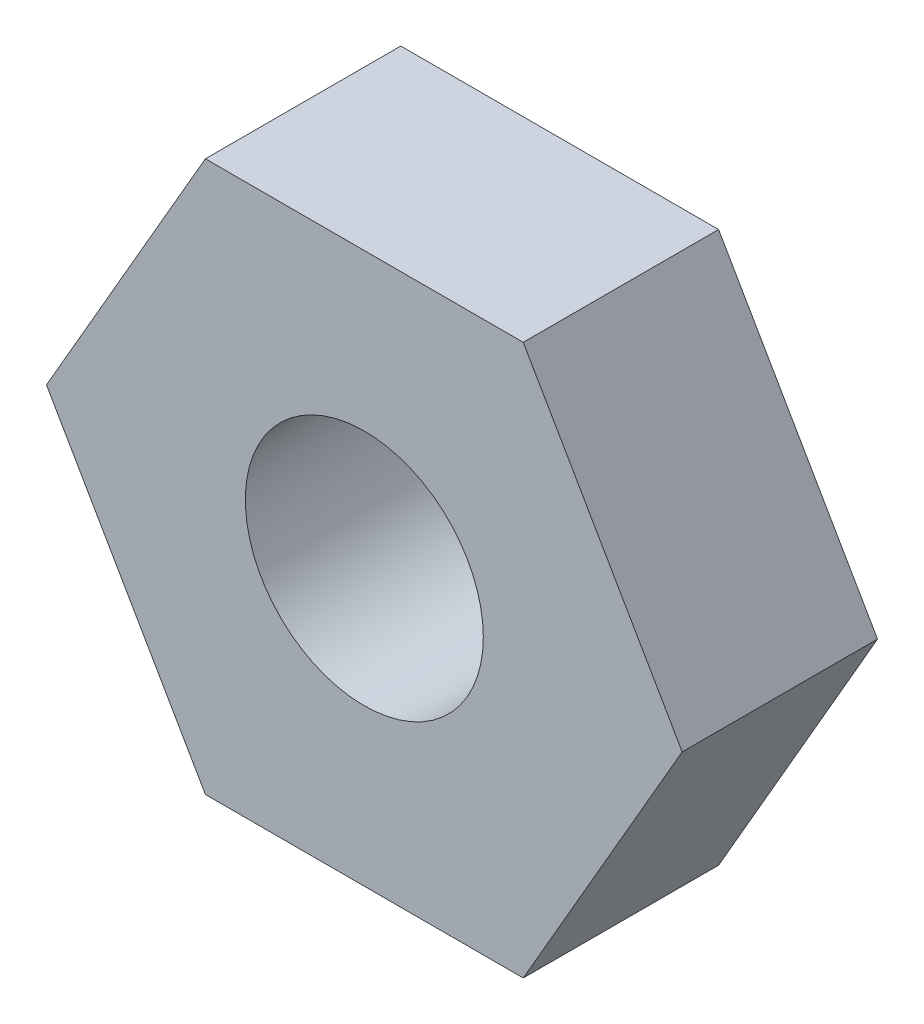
from build123d import *

# Parameters (mm, degrees)
BOSS_EXTRUDE1_DEPTH = 2.794
SKETCH2_R           = 1.7018
CUT_EXTRUDE1_DEPTH  = 7.631216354


with BuildPart() as part:
    # Sketch1 → Boss-Extrude1 (new body)
    with BuildSketch(Plane.XY):
        Polygon((4.54605602, 0), (2.27302801, 3.937), (-2.27302801, 3.937), (-4.54605602, 0), (-2.27302801, -3.937), (2.27302801, -3.937), align=None)
    extrude(amount=BOSS_EXTRUDE1_DEPTH)

    # Sketch2 → Cut-Extrude1 (cut, through all)
    with BuildSketch(Plane.XY.offset(2.794)):
        Circle(SKETCH2_R)
    extrude(amount=-CUT_EXTRUDE1_DEPTH, mode=Mode.SUBTRACT)


solid = part.part
